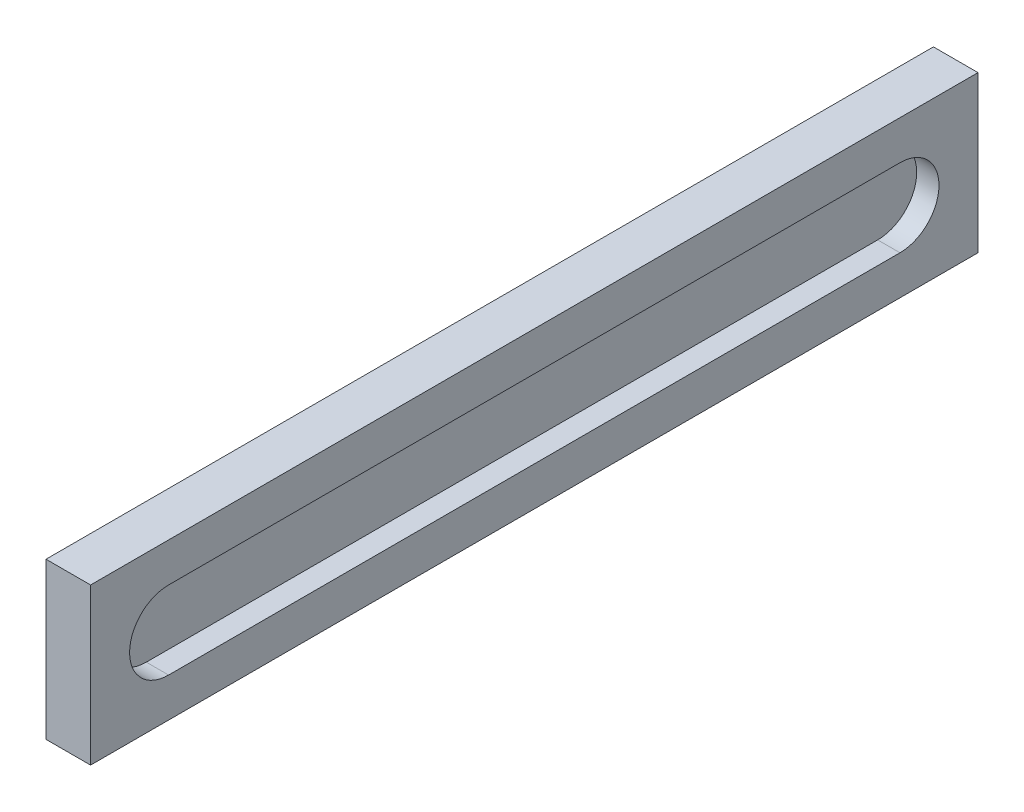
from build123d import *

# Parameters (mm, degrees)
SKETCH2_W           = 398.100558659
SKETCH2_H           = 70
BOSS_EXTRUDE1_DEPTH = 20
CUT_EXTRUDE1_DEPTH  = 10


with BuildPart() as part:
    # Sketch2 → Boss-Extrude1 (new body)
    with BuildSketch(Plane(origin=(0, 0, 0), x_dir=(0, 0, -1), z_dir=(1, 0, 0))):
        with Locations((199.05027933, 35)):
            Rectangle(SKETCH2_W, SKETCH2_H)
    extrude(amount=BOSS_EXTRUDE1_DEPTH)

    # Sketch3 → Cut-Extrude1 (cut)
    with BuildSketch(Plane(origin=(20, 0, 0), x_dir=(0, 0, -1), z_dir=(1, 0, 0))):
        with BuildLine():
            Line((35, 52.5), (363.100558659, 52.5))
            ThreePointArc((363.100558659, 52.5), (380.600558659, 35), (363.100558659, 17.5))
            Line((363.100558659, 17.5), (35, 17.5))
            ThreePointArc((35, 17.5), (17.5, 35), (35, 52.5))
        make_face()
    extrude(amount=-CUT_EXTRUDE1_DEPTH, mode=Mode.SUBTRACT)


solid = part.part
